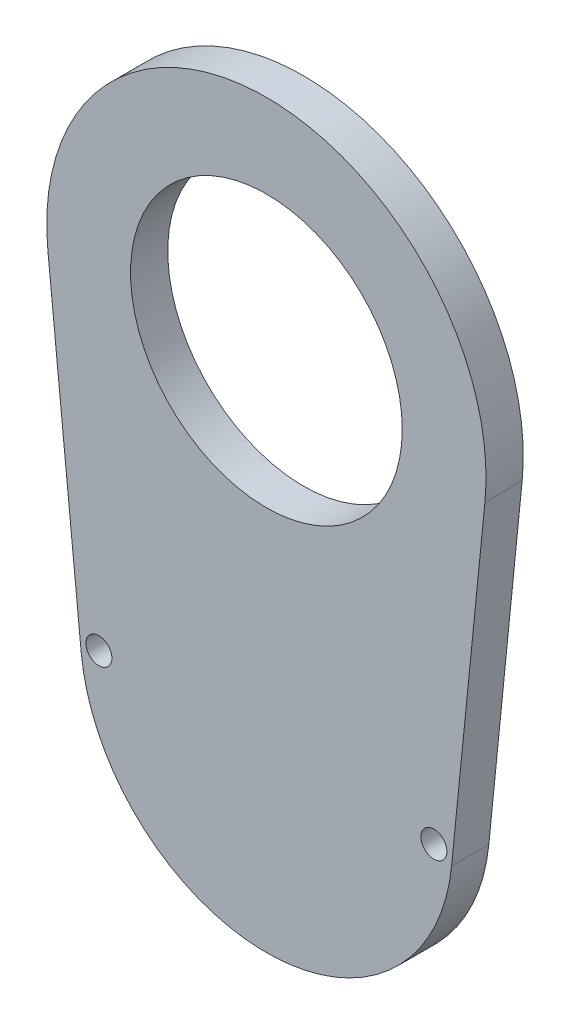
ISO-10303-21;
HEADER;
FILE_DESCRIPTION(('STEP AP214'),'2;1');
FILE_NAME('part.step','',(''),(''),'','','');
FILE_SCHEMA(('AUTOMOTIVE_DESIGN { 1 0 10303 214 1 1 1 1 }'));
ENDSEC;
DATA;
#1=APPLICATION_CONTEXT('core data for automotive mechanical design processes');
#2=APPLICATION_PROTOCOL_DEFINITION('international standard','automotive_design',2000,#1);
#3=PRODUCT_CONTEXT('',#1,'mechanical');
#4=PRODUCT('Part','Part','',(#3));
#5=PRODUCT_RELATED_PRODUCT_CATEGORY('part','',(#4));
#6=PRODUCT_DEFINITION_FORMATION('','',#4);
#7=PRODUCT_DEFINITION_CONTEXT('part definition',#1,'design');
#8=PRODUCT_DEFINITION('design','',#6,#7);
#9=PRODUCT_DEFINITION_SHAPE('','',#8);
#10=(LENGTH_UNIT() NAMED_UNIT(*) SI_UNIT(.MILLI.,.METRE.));
#11=(NAMED_UNIT(*) PLANE_ANGLE_UNIT() SI_UNIT($,.RADIAN.));
#12=(NAMED_UNIT(*) SI_UNIT($,.STERADIAN.) SOLID_ANGLE_UNIT());
#13=UNCERTAINTY_MEASURE_WITH_UNIT(LENGTH_MEASURE(1.E-05),#10,'distance_accuracy_value','');
#14=(GEOMETRIC_REPRESENTATION_CONTEXT(3) GLOBAL_UNCERTAINTY_ASSIGNED_CONTEXT((#13)) GLOBAL_UNIT_ASSIGNED_CONTEXT((#10,
#11,#12)) REPRESENTATION_CONTEXT('',''));
#15=CARTESIAN_POINT('',(0.,0.,0.));
#16=DIRECTION('',(0.,0.,1.));
#17=DIRECTION('',(1.,0.,0.));
#18=AXIS2_PLACEMENT_3D('',#15,#16,#17);
#19=CARTESIAN_POINT('',(0.,0.,2.54));
#20=DIRECTION('',(0.,0.,-1.));
#21=DIRECTION('',(-1.,0.,0.));
#22=AXIS2_PLACEMENT_3D('',#19,#20,#21);
#23=CYLINDRICAL_SURFACE('',#22,14.986);
#24=CARTESIAN_POINT('',(0.,0.,0.));
#25=DIRECTION('',(0.,0.,1.));
#26=DIRECTION('',(1.,0.,0.));
#27=AXIS2_PLACEMENT_3D('',#24,#25,#26);
#28=CIRCLE('',#27,14.986);
#29=CARTESIAN_POINT('',(14.9108817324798,-1.4986,0.));
#30=VERTEX_POINT('',#29);
#31=CARTESIAN_POINT('',(-14.9108817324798,-1.49860000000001,0.));
#32=VERTEX_POINT('',#31);
#33=EDGE_CURVE('E111',#30,#32,#28,.T.);
#34=ORIENTED_EDGE('',*,*,#33,.T.);
#35=DIRECTION('',(0.,0.,-1.));
#36=VECTOR('',#35,1.);
#37=CARTESIAN_POINT('',(-14.9108817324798,-1.49860000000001,2.54));
#38=LINE('',#37,#36);
#39=CARTESIAN_POINT('',(-14.9108817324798,-1.49860000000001,2.54));
#40=VERTEX_POINT('',#39);
#41=EDGE_CURVE('E11',#40,#32,#38,.T.);
#42=ORIENTED_EDGE('',*,*,#41,.F.);
#43=CARTESIAN_POINT('',(0.,0.,2.54));
#44=DIRECTION('',(0.,0.,1.));
#45=DIRECTION('',(1.,0.,0.));
#46=AXIS2_PLACEMENT_3D('',#43,#44,#45);
#47=CIRCLE('',#46,14.986);
#48=CARTESIAN_POINT('',(14.9108817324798,-1.4986,2.54));
#49=VERTEX_POINT('',#48);
#50=EDGE_CURVE('E88',#49,#40,#47,.T.);
#51=ORIENTED_EDGE('',*,*,#50,.F.);
#52=DIRECTION('',(0.,0.,-1.));
#53=VECTOR('',#52,1.);
#54=CARTESIAN_POINT('',(14.9108817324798,-1.4986,2.54));
#55=LINE('',#54,#53);
#56=EDGE_CURVE('E54',#49,#30,#55,.T.);
#57=ORIENTED_EDGE('',*,*,#56,.T.);
#58=EDGE_LOOP('',(#34,#42,#51,#57));
#59=FACE_BOUND('',#58,.T.);
#60=ADVANCED_FACE('F37',(#59),#23,.T.);
#61=CARTESIAN_POINT('',(-14.9108817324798,-1.49860000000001,2.54));
#62=DIRECTION('',(0.99498743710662,0.100000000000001,0.));
#63=DIRECTION('',(-0.100000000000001,0.99498743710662,0.));
#64=AXIS2_PLACEMENT_3D('',#61,#62,#63);
#65=PLANE('',#64);
#66=DIRECTION('',(0.100000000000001,-0.99498743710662,0.));
#67=VECTOR('',#66,1.);
#68=CARTESIAN_POINT('',(-14.9108817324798,-1.49860000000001,0.));
#69=LINE('',#68,#67);
#70=CARTESIAN_POINT('',(-12.6363404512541,-24.13,0.));
#71=VERTEX_POINT('',#70);
#72=EDGE_CURVE('E93',#32,#71,#69,.T.);
#73=ORIENTED_EDGE('',*,*,#72,.T.);
#74=DIRECTION('',(0.,0.,-1.));
#75=VECTOR('',#74,1.);
#76=CARTESIAN_POINT('',(-12.6363404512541,-24.13,2.54));
#77=LINE('',#76,#75);
#78=CARTESIAN_POINT('',(-12.6363404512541,-24.13,2.54));
#79=VERTEX_POINT('',#78);
#80=EDGE_CURVE('E46',#79,#71,#77,.T.);
#81=ORIENTED_EDGE('',*,*,#80,.F.);
#82=DIRECTION('',(0.100000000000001,-0.99498743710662,0.));
#83=VECTOR('',#82,1.);
#84=CARTESIAN_POINT('',(-14.9108817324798,-1.49860000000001,2.54));
#85=LINE('',#84,#83);
#86=EDGE_CURVE('E80',#40,#79,#85,.T.);
#87=ORIENTED_EDGE('',*,*,#86,.F.);
#88=ORIENTED_EDGE('',*,*,#41,.T.);
#89=EDGE_LOOP('',(#73,#81,#87,#88));
#90=FACE_BOUND('',#89,.T.);
#91=ADVANCED_FACE('F92',(#90),#65,.F.);
#92=CARTESIAN_POINT('',(0.,-22.86,2.54));
#93=DIRECTION('',(0.,0.,-1.));
#94=DIRECTION('',(-1.,0.,0.));
#95=AXIS2_PLACEMENT_3D('',#92,#93,#94);
#96=CYLINDRICAL_SURFACE('',#95,12.7);
#97=CARTESIAN_POINT('',(0.,-22.86,0.));
#98=DIRECTION('',(0.,0.,1.));
#99=DIRECTION('',(1.,0.,0.));
#100=AXIS2_PLACEMENT_3D('',#97,#98,#99);
#101=CIRCLE('',#100,12.7);
#102=CARTESIAN_POINT('',(12.6363404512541,-24.13,0.));
#103=VERTEX_POINT('',#102);
#104=EDGE_CURVE('E114',#71,#103,#101,.T.);
#105=ORIENTED_EDGE('',*,*,#104,.T.);
#106=DIRECTION('',(0.,0.,-1.));
#107=VECTOR('',#106,1.);
#108=CARTESIAN_POINT('',(12.6363404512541,-24.13,2.54));
#109=LINE('',#108,#107);
#110=CARTESIAN_POINT('',(12.6363404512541,-24.13,2.54));
#111=VERTEX_POINT('',#110);
#112=EDGE_CURVE('E69',#111,#103,#109,.T.);
#113=ORIENTED_EDGE('',*,*,#112,.F.);
#114=CARTESIAN_POINT('',(0.,-22.86,2.54));
#115=DIRECTION('',(0.,0.,1.));
#116=DIRECTION('',(1.,0.,0.));
#117=AXIS2_PLACEMENT_3D('',#114,#115,#116);
#118=CIRCLE('',#117,12.7);
#119=EDGE_CURVE('E87',#79,#111,#118,.T.);
#120=ORIENTED_EDGE('',*,*,#119,.F.);
#121=ORIENTED_EDGE('',*,*,#80,.T.);
#122=EDGE_LOOP('',(#105,#113,#120,#121));
#123=FACE_BOUND('',#122,.T.);
#124=ADVANCED_FACE('F96',(#123),#96,.T.);
#125=CARTESIAN_POINT('',(11.43,-23.4329359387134,2.54));
#126=DIRECTION('',(0.,0.,-1.));
#127=DIRECTION('',(-1.,0.,0.));
#128=AXIS2_PLACEMENT_3D('',#125,#126,#127);
#129=CYLINDRICAL_SURFACE('',#128,0.889000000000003);
#130=CARTESIAN_POINT('',(11.43,-23.4329359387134,2.54));
#131=DIRECTION('',(0.,0.,1.));
#132=DIRECTION('',(1.,0.,0.));
#133=AXIS2_PLACEMENT_3D('',#130,#131,#132);
#134=CIRCLE('',#133,0.889000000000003);
#135=CARTESIAN_POINT('',(12.319,-23.4329359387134,2.54));
#136=VERTEX_POINT('',#135);
#137=EDGE_CURVE('E99',#136,#136,#134,.F.);
#138=ORIENTED_EDGE('',*,*,#137,.F.);
#139=EDGE_LOOP('',(#138));
#140=FACE_BOUND('',#139,.T.);
#141=CARTESIAN_POINT('',(11.43,-23.4329359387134,0.));
#142=DIRECTION('',(0.,0.,1.));
#143=DIRECTION('',(1.,0.,0.));
#144=AXIS2_PLACEMENT_3D('',#141,#142,#143);
#145=CIRCLE('',#144,0.889000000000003);
#146=CARTESIAN_POINT('',(12.319,-23.4329359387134,0.));
#147=VERTEX_POINT('',#146);
#148=EDGE_CURVE('E119',#147,#147,#145,.F.);
#149=ORIENTED_EDGE('',*,*,#148,.T.);
#150=EDGE_LOOP('',(#149));
#151=FACE_BOUND('',#150,.T.);
#152=ADVANCED_FACE('F155',(#140,#151),#129,.F.);
#153=CARTESIAN_POINT('',(14.9108817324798,-1.49860000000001,2.54));
#154=DIRECTION('',(0.99498743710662,-0.1,0.));
#155=DIRECTION('',(0.1,0.99498743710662,0.));
#156=AXIS2_PLACEMENT_3D('',#153,#154,#155);
#157=PLANE('',#156);
#158=DIRECTION('',(-0.1,-0.99498743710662,0.));
#159=VECTOR('',#158,1.);
#160=CARTESIAN_POINT('',(14.9108817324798,-1.49860000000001,0.));
#161=LINE('',#160,#159);
#162=EDGE_CURVE('E116',#30,#103,#161,.T.);
#163=ORIENTED_EDGE('',*,*,#162,.F.);
#164=ORIENTED_EDGE('',*,*,#56,.F.);
#165=DIRECTION('',(-0.1,-0.99498743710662,0.));
#166=VECTOR('',#165,1.);
#167=CARTESIAN_POINT('',(14.9108817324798,-1.49860000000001,2.54));
#168=LINE('',#167,#166);
#169=EDGE_CURVE('E97',#49,#111,#168,.T.);
#170=ORIENTED_EDGE('',*,*,#169,.T.);
#171=ORIENTED_EDGE('',*,*,#112,.T.);
#172=EDGE_LOOP('',(#163,#164,#170,#171));
#173=FACE_BOUND('',#172,.T.);
#174=ADVANCED_FACE('F156',(#173),#157,.T.);
#175=CARTESIAN_POINT('',(0.,0.,2.54));
#176=DIRECTION('',(0.,0.,-1.));
#177=DIRECTION('',(-1.,0.,0.));
#178=AXIS2_PLACEMENT_3D('',#175,#176,#177);
#179=CYLINDRICAL_SURFACE('',#178,9.271);
#180=CARTESIAN_POINT('',(0.,0.,2.54));
#181=DIRECTION('',(0.,0.,1.));
#182=DIRECTION('',(1.,0.,0.));
#183=AXIS2_PLACEMENT_3D('',#180,#181,#182);
#184=CIRCLE('',#183,9.271);
#185=CARTESIAN_POINT('',(9.271,0.,2.54));
#186=VERTEX_POINT('',#185);
#187=EDGE_CURVE('E125',#186,#186,#184,.T.);
#188=ORIENTED_EDGE('',*,*,#187,.T.);
#189=EDGE_LOOP('',(#188));
#190=FACE_BOUND('',#189,.T.);
#191=CARTESIAN_POINT('',(0.,0.,0.));
#192=DIRECTION('',(0.,0.,1.));
#193=DIRECTION('',(1.,0.,0.));
#194=AXIS2_PLACEMENT_3D('',#191,#192,#193);
#195=CIRCLE('',#194,9.271);
#196=CARTESIAN_POINT('',(9.271,0.,0.));
#197=VERTEX_POINT('',#196);
#198=EDGE_CURVE('E108',#197,#197,#195,.T.);
#199=ORIENTED_EDGE('',*,*,#198,.F.);
#200=EDGE_LOOP('',(#199));
#201=FACE_BOUND('',#200,.T.);
#202=ADVANCED_FACE('F39',(#190,#201),#179,.F.);
#203=CARTESIAN_POINT('',(-11.43,-23.4329359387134,2.54));
#204=DIRECTION('',(0.,0.,-1.));
#205=DIRECTION('',(-1.,0.,0.));
#206=AXIS2_PLACEMENT_3D('',#203,#204,#205);
#207=CYLINDRICAL_SURFACE('',#206,0.889000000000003);
#208=CARTESIAN_POINT('',(-11.43,-23.4329359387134,2.54));
#209=DIRECTION('',(0.,0.,1.));
#210=DIRECTION('',(1.,0.,0.));
#211=AXIS2_PLACEMENT_3D('',#208,#209,#210);
#212=CIRCLE('',#211,0.889000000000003);
#213=CARTESIAN_POINT('',(-10.541,-23.4329359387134,2.54));
#214=VERTEX_POINT('',#213);
#215=EDGE_CURVE('E105',#214,#214,#212,.T.);
#216=ORIENTED_EDGE('',*,*,#215,.T.);
#217=EDGE_LOOP('',(#216));
#218=FACE_BOUND('',#217,.T.);
#219=CARTESIAN_POINT('',(-11.43,-23.4329359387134,0.));
#220=DIRECTION('',(0.,0.,1.));
#221=DIRECTION('',(1.,0.,0.));
#222=AXIS2_PLACEMENT_3D('',#219,#220,#221);
#223=CIRCLE('',#222,0.889000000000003);
#224=CARTESIAN_POINT('',(-10.541,-23.4329359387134,0.));
#225=VERTEX_POINT('',#224);
#226=EDGE_CURVE('E122',#225,#225,#223,.T.);
#227=ORIENTED_EDGE('',*,*,#226,.F.);
#228=EDGE_LOOP('',(#227));
#229=FACE_BOUND('',#228,.T.);
#230=ADVANCED_FACE('F137',(#218,#229),#207,.F.);
#231=CARTESIAN_POINT('',(0.,0.,2.54));
#232=DIRECTION('',(0.,0.,1.));
#233=DIRECTION('',(1.,0.,0.));
#234=AXIS2_PLACEMENT_3D('',#231,#232,#233);
#235=PLANE('',#234);
#236=ORIENTED_EDGE('',*,*,#187,.F.);
#237=EDGE_LOOP('',(#236));
#238=FACE_BOUND('',#237,.T.);
#239=ORIENTED_EDGE('',*,*,#50,.T.);
#240=ORIENTED_EDGE('',*,*,#86,.T.);
#241=ORIENTED_EDGE('',*,*,#119,.T.);
#242=ORIENTED_EDGE('',*,*,#169,.F.);
#243=EDGE_LOOP('',(#239,#240,#241,#242));
#244=FACE_BOUND('',#243,.T.);
#245=ORIENTED_EDGE('',*,*,#137,.T.);
#246=EDGE_LOOP('',(#245));
#247=FACE_BOUND('',#246,.T.);
#248=ORIENTED_EDGE('',*,*,#215,.F.);
#249=EDGE_LOOP('',(#248));
#250=FACE_BOUND('',#249,.T.);
#251=ADVANCED_FACE('F83',(#238,#244,#247,#250),#235,.T.);
#252=CARTESIAN_POINT('',(0.,0.,0.));
#253=DIRECTION('',(0.,0.,1.));
#254=DIRECTION('',(1.,0.,0.));
#255=AXIS2_PLACEMENT_3D('',#252,#253,#254);
#256=PLANE('',#255);
#257=ORIENTED_EDGE('',*,*,#198,.T.);
#258=EDGE_LOOP('',(#257));
#259=FACE_BOUND('',#258,.T.);
#260=ORIENTED_EDGE('',*,*,#33,.F.);
#261=ORIENTED_EDGE('',*,*,#162,.T.);
#262=ORIENTED_EDGE('',*,*,#104,.F.);
#263=ORIENTED_EDGE('',*,*,#72,.F.);
#264=EDGE_LOOP('',(#260,#261,#262,#263));
#265=FACE_BOUND('',#264,.T.);
#266=ORIENTED_EDGE('',*,*,#148,.F.);
#267=EDGE_LOOP('',(#266));
#268=FACE_BOUND('',#267,.T.);
#269=ORIENTED_EDGE('',*,*,#226,.T.);
#270=EDGE_LOOP('',(#269));
#271=FACE_BOUND('',#270,.T.);
#272=ADVANCED_FACE('F136',(#259,#265,#268,#271),#256,.F.);
#273=CLOSED_SHELL('',(#60,#91,#124,#152,#174,#202,#230,#251,#272));
#274=MANIFOLD_SOLID_BREP('B2',#273);
#275=ADVANCED_BREP_SHAPE_REPRESENTATION('',(#18,#274),#14);
#276=SHAPE_DEFINITION_REPRESENTATION(#9,#275);
ENDSEC;
END-ISO-10303-21;
